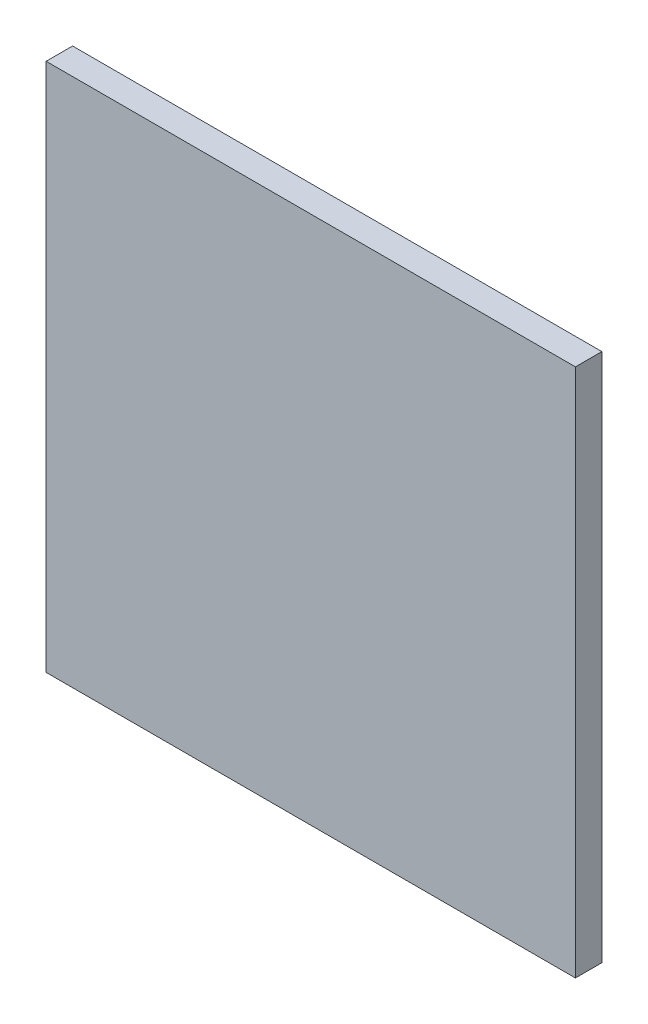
from build123d import *

# Parameters (mm, degrees)
ESQUISSE1_W        = 4
ESQUISSE1_H        = 4
BOSS_EXTRU_1_DEPTH = 0.2


with BuildPart() as part:
    # Esquisse1 → Boss.-Extru.1 (new body)
    with BuildSketch(Plane.XY):
        Rectangle(ESQUISSE1_W, ESQUISSE1_H)
    extrude(amount=BOSS_EXTRU_1_DEPTH)


solid = part.part
